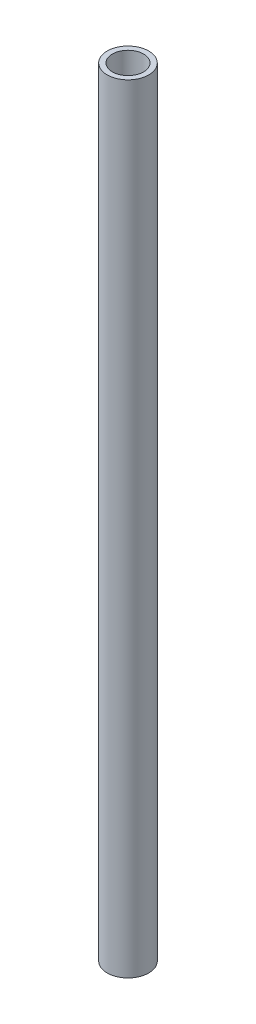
from build123d import *

# Parameters (mm, degrees)
SKIZZE1_R                       = 4
SKIZZE1_R_2                     = 3
AUFSATZ_LINEAR_AUSTRAGEN1_DEPTH = 150


with BuildPart() as part:
    # Skizze1 → Aufsatz-Linear austragen1 (new body)
    with BuildSketch(Plane(origin=(0, 0, 0), x_dir=(1, 0, 0), z_dir=(0, 1, 0))):
        with Locations(Location((0, 0, 0), (0, 0, 270))):
            Circle(SKIZZE1_R)
        with Locations(Location((0, 0, 0), (0, 0, 270))):
            Circle(SKIZZE1_R_2, mode=Mode.SUBTRACT)
    extrude(amount=AUFSATZ_LINEAR_AUSTRAGEN1_DEPTH)


solid = part.part
